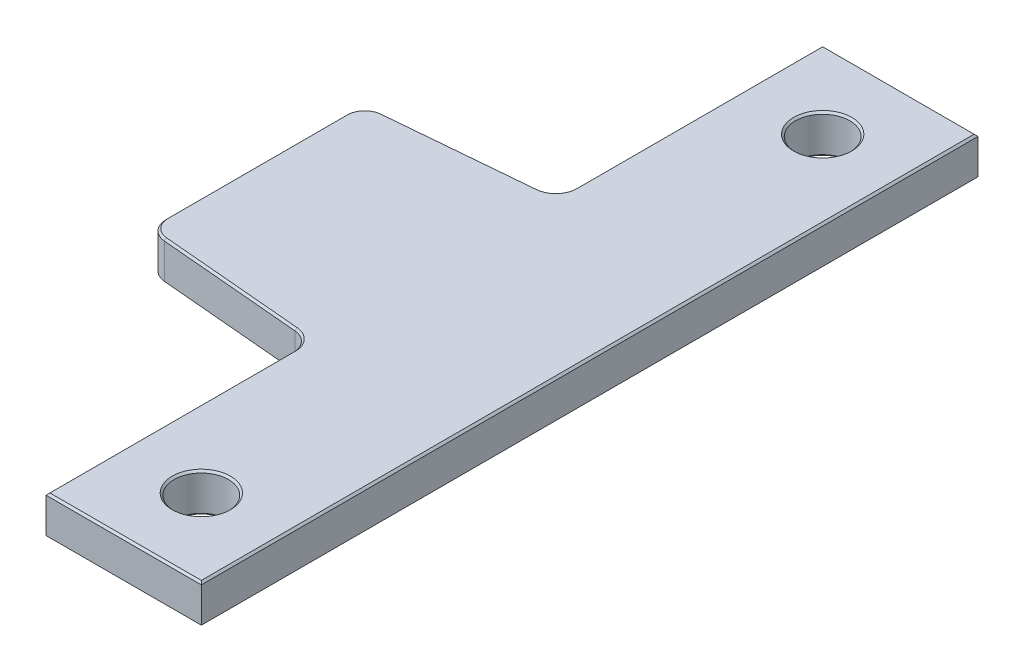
from build123d import *

# Parameters (mm, degrees)
ESQUISSE1_W                     = 90
ESQUISSE1_H                     = 200
BOSS_EXTRU_1_DEPTH              = 10
DIAM_TRE_DU_PER_AGE_14_0_14_1_D = 14
ENL_V_MAT_EXTRU_1_DEPTH         = 135.907375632
CONG_1_R                        = 5
CHANFREIN1_SIZE                 = 0.5


with BuildPart() as part:
    # Esquisse1 → Boss.-Extru.1 (new body)
    with BuildSketch(Plane(origin=(0, 0, 0), x_dir=(1, 0, 0), z_dir=(0, 1, 0))):
        with Locations((-45, 0)):
            Rectangle(ESQUISSE1_W, ESQUISSE1_H)
    extrude(amount=BOSS_EXTRU_1_DEPTH)

    # Diam_tre du per_age _14.0 _14_1 (through all)
    with Locations(Plane(origin=(0, 10, 0), x_dir=(-1, 0, 0), z_dir=(0, 1, 0))):
        with Locations((20, 80), (20, -80)):
            Hole(DIAM_TRE_DU_PER_AGE_14_0_14_1_D / 2)

    # Esquisse4 → Enl_v. mat.-Extru.1 (cut, through all)
    with BuildSketch(Plane(origin=(0, 10, 0), x_dir=(1, 0, 0), z_dir=(0, 1, 0))):
        Polygon((-40, -100), (-40, -31.7), (-86, -27.677248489), (-86, 27.677248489), (-40, 31.7), (-40, 100), (-90, 100), (-90, -100), align=None)
    extrude(amount=-ENL_V_MAT_EXTRU_1_DEPTH, mode=Mode.SUBTRACT)

    # Cong_1
    cong_1_edges = [part.edges().sort_by_distance(p)[0] for p in [
        (-40, 5, -31.7),
        (-86, 5, -27.677248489),
        (-86, 5, 27.677248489),
        (-40, 5, 31.7),
    ]]
    fillet(cong_1_edges, radius=CONG_1_R)

    # Chanfrein1
    chanfrein1_edges = [part.edges().sort_by_distance(p)[0] for p in [
        (-27, 10, -80),
        (-27, 0, -80),
        (-27, 10, 80),
        (-27, 0, 80),
        (-20, 0, 100),
        (-20, 10, 100),
        (-40, 0, 68.140913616),
        (-40, 10, 68.140913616),
        (0, 10, 0),
        (-63, 10, 29.688624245),
        (-63, 0, 29.688624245),
        (-86, 10, 0),
        (-86, 0, 0),
        (-20, 0, -100),
        (-40, 10, -68.140913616),
        (-63, 10, -29.688624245),
        (-84.686323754, 10, -26.47344097),
        (-84.686323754, 10, 26.47344097),
        (-40, 0, -68.140913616),
        (-63, 0, -29.688624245),
        (-84.686323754, 0, -26.47344097),
        (0, 0, 0),
        (-84.686323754, 0, 26.47344097),
        (-41.313676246, 10, 32.903807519),
        (-41.313676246, 0, 32.903807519),
        (-41.313676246, 10, -32.903807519),
        (-41.313676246, 0, -32.903807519),
        (-20, 10, -100),
    ]]
    chamfer(chanfrein1_edges, length=CHANFREIN1_SIZE)


solid = part.part
